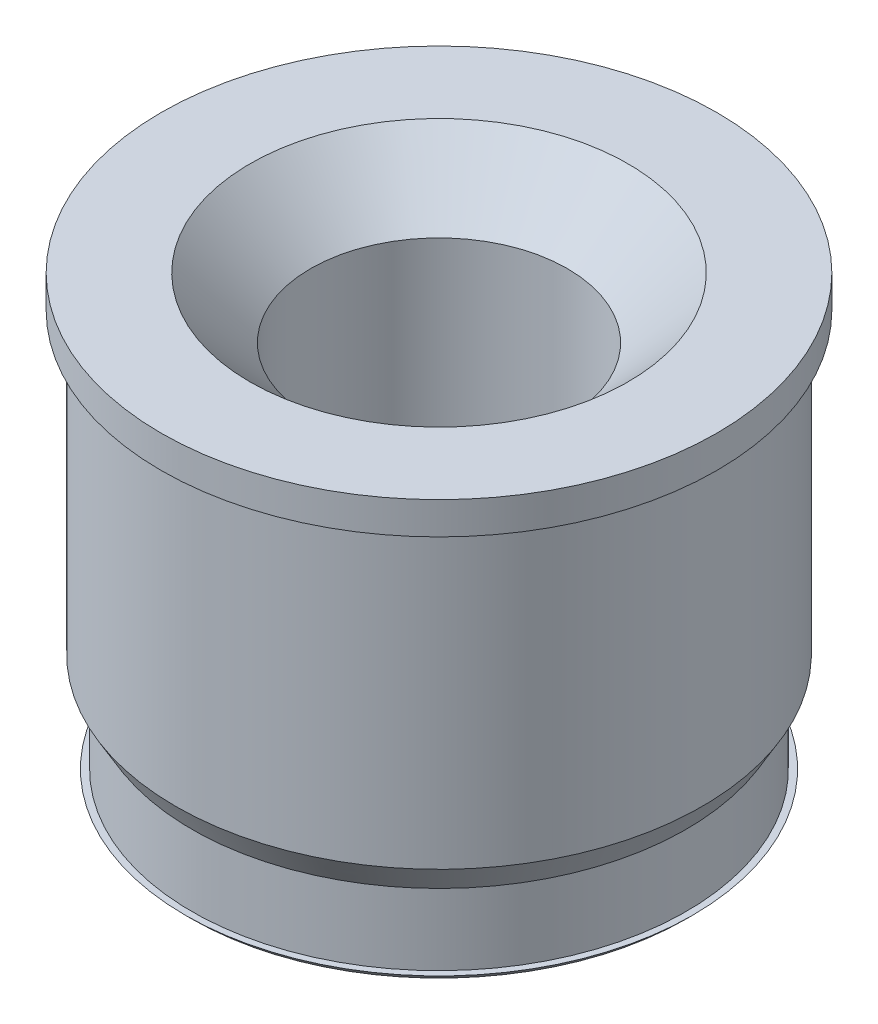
ISO-10303-21;
HEADER;
FILE_DESCRIPTION(('STEP AP214'),'2;1');
FILE_NAME('part.step','',(''),(''),'','','');
FILE_SCHEMA(('AUTOMOTIVE_DESIGN { 1 0 10303 214 1 1 1 1 }'));
ENDSEC;
DATA;
#1=APPLICATION_CONTEXT('core data for automotive mechanical design processes');
#2=APPLICATION_PROTOCOL_DEFINITION('international standard','automotive_design',2000,#1);
#3=PRODUCT_CONTEXT('',#1,'mechanical');
#4=PRODUCT('Part','Part','',(#3));
#5=PRODUCT_RELATED_PRODUCT_CATEGORY('part','',(#4));
#6=PRODUCT_DEFINITION_FORMATION('','',#4);
#7=PRODUCT_DEFINITION_CONTEXT('part definition',#1,'design');
#8=PRODUCT_DEFINITION('design','',#6,#7);
#9=PRODUCT_DEFINITION_SHAPE('','',#8);
#10=(LENGTH_UNIT() NAMED_UNIT(*) SI_UNIT(.MILLI.,.METRE.));
#11=(NAMED_UNIT(*) PLANE_ANGLE_UNIT() SI_UNIT($,.RADIAN.));
#12=(NAMED_UNIT(*) SI_UNIT($,.STERADIAN.) SOLID_ANGLE_UNIT());
#13=UNCERTAINTY_MEASURE_WITH_UNIT(LENGTH_MEASURE(1.E-05),#10,'distance_accuracy_value','');
#14=(GEOMETRIC_REPRESENTATION_CONTEXT(3) GLOBAL_UNCERTAINTY_ASSIGNED_CONTEXT((#13)) GLOBAL_UNIT_ASSIGNED_CONTEXT((#10,
#11,#12)) REPRESENTATION_CONTEXT('',''));
#15=CARTESIAN_POINT('',(0.,0.,0.));
#16=DIRECTION('',(0.,0.,1.));
#17=DIRECTION('',(1.,0.,0.));
#18=AXIS2_PLACEMENT_3D('',#15,#16,#17);
#19=CARTESIAN_POINT('',(0.,-3.429,0.));
#20=DIRECTION('',(0.,1.,0.));
#21=DIRECTION('',(0.,0.,1.));
#22=AXIS2_PLACEMENT_3D('',#19,#20,#21);
#23=CYLINDRICAL_SURFACE('',#22,1.9431);
#24=CARTESIAN_POINT('',(0.,-2.8184881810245,0.));
#25=DIRECTION('',(0.,-1.,0.));
#26=DIRECTION('',(0.,0.,-1.));
#27=AXIS2_PLACEMENT_3D('',#24,#25,#26);
#28=CIRCLE('',#27,1.9431);
#29=CARTESIAN_POINT('',(0.,-2.8184881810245,-1.9431));
#30=VERTEX_POINT('',#29);
#31=EDGE_CURVE('E55',#30,#30,#28,.F.);
#32=ORIENTED_EDGE('',*,*,#31,.F.);
#33=EDGE_LOOP('',(#32));
#34=FACE_BOUND('',#33,.T.);
#35=CARTESIAN_POINT('',(0.,-3.3782,0.));
#36=DIRECTION('',(0.,-1.,0.));
#37=DIRECTION('',(0.,0.,-1.));
#38=AXIS2_PLACEMENT_3D('',#35,#36,#37);
#39=CIRCLE('',#38,1.9431);
#40=CARTESIAN_POINT('',(0.,-3.3782,-1.9431));
#41=VERTEX_POINT('',#40);
#42=EDGE_CURVE('E56',#41,#41,#39,.F.);
#43=ORIENTED_EDGE('',*,*,#42,.T.);
#44=EDGE_LOOP('',(#43));
#45=FACE_BOUND('',#44,.T.);
#46=ADVANCED_FACE('F35',(#34,#45),#23,.T.);
#47=CARTESIAN_POINT('',(0.,-2.59851772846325,0.));
#48=DIRECTION('',(0.,1.,0.));
#49=DIRECTION('',(0.,0.,1.));
#50=AXIS2_PLACEMENT_3D('',#47,#48,#49);
#51=CYLINDRICAL_SURFACE('',#50,2.0701);
#52=CARTESIAN_POINT('',(0.,-2.59851772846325,0.));
#53=DIRECTION('',(0.,-1.,0.));
#54=DIRECTION('',(0.,0.,-1.));
#55=AXIS2_PLACEMENT_3D('',#52,#53,#54);
#56=CIRCLE('',#55,2.0701);
#57=CARTESIAN_POINT('',(0.,-2.59851772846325,-2.0701));
#58=VERTEX_POINT('',#57);
#59=EDGE_CURVE('E59',#58,#58,#56,.T.);
#60=ORIENTED_EDGE('',*,*,#59,.F.);
#61=EDGE_LOOP('',(#60));
#62=FACE_BOUND('',#61,.T.);
#63=CARTESIAN_POINT('',(0.,-0.254,0.));
#64=DIRECTION('',(0.,1.,0.));
#65=DIRECTION('',(0.,0.,1.));
#66=AXIS2_PLACEMENT_3D('',#63,#64,#65);
#67=CIRCLE('',#66,2.0701);
#68=CARTESIAN_POINT('',(0.,-0.254,2.0701));
#69=VERTEX_POINT('',#68);
#70=EDGE_CURVE('E64',#69,#69,#67,.F.);
#71=ORIENTED_EDGE('',*,*,#70,.T.);
#72=EDGE_LOOP('',(#71));
#73=FACE_BOUND('',#72,.T.);
#74=ADVANCED_FACE('F99',(#62,#73),#51,.T.);
#75=CARTESIAN_POINT('',(0.,-0.254,0.));
#76=DIRECTION('',(0.,1.,0.));
#77=DIRECTION('',(0.,0.,1.));
#78=AXIS2_PLACEMENT_3D('',#75,#76,#77);
#79=CYLINDRICAL_SURFACE('',#78,2.1844);
#80=CARTESIAN_POINT('',(0.,-0.254,0.));
#81=DIRECTION('',(0.,1.,0.));
#82=DIRECTION('',(0.,0.,1.));
#83=AXIS2_PLACEMENT_3D('',#80,#81,#82);
#84=CIRCLE('',#83,2.1844);
#85=CARTESIAN_POINT('',(0.,-0.254,2.1844));
#86=VERTEX_POINT('',#85);
#87=EDGE_CURVE('E67',#86,#86,#84,.T.);
#88=ORIENTED_EDGE('',*,*,#87,.T.);
#89=EDGE_LOOP('',(#88));
#90=FACE_BOUND('',#89,.T.);
#91=CARTESIAN_POINT('',(0.,0.,0.));
#92=DIRECTION('',(0.,1.,0.));
#93=DIRECTION('',(0.,0.,1.));
#94=AXIS2_PLACEMENT_3D('',#91,#92,#93);
#95=CIRCLE('',#94,2.1844);
#96=CARTESIAN_POINT('',(0.,0.,2.1844));
#97=VERTEX_POINT('',#96);
#98=EDGE_CURVE('E70',#97,#97,#95,.T.);
#99=ORIENTED_EDGE('',*,*,#98,.F.);
#100=EDGE_LOOP('',(#99));
#101=FACE_BOUND('',#100,.T.);
#102=ADVANCED_FACE('F105',(#90,#101),#79,.T.);
#103=CARTESIAN_POINT('',(0.,-0.254,0.));
#104=DIRECTION('',(0.,1.,0.));
#105=DIRECTION('',(0.,0.,1.));
#106=AXIS2_PLACEMENT_3D('',#103,#104,#105);
#107=PLANE('',#106);
#108=ORIENTED_EDGE('',*,*,#70,.F.);
#109=EDGE_LOOP('',(#108));
#110=FACE_BOUND('',#109,.T.);
#111=ORIENTED_EDGE('',*,*,#87,.F.);
#112=EDGE_LOOP('',(#111));
#113=FACE_BOUND('',#112,.T.);
#114=ADVANCED_FACE('F141',(#110,#113),#107,.F.);
#115=CARTESIAN_POINT('',(0.,0.,0.));
#116=DIRECTION('',(0.,1.,0.));
#117=DIRECTION('',(0.,0.,1.));
#118=AXIS2_PLACEMENT_3D('',#115,#116,#117);
#119=PLANE('',#118);
#120=CARTESIAN_POINT('',(0.,0.,0.));
#121=DIRECTION('',(0.,1.,0.));
#122=DIRECTION('',(0.,0.,1.));
#123=AXIS2_PLACEMENT_3D('',#120,#121,#122);
#124=CIRCLE('',#123,1.48620540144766);
#125=CARTESIAN_POINT('',(0.,0.,1.48620540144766));
#126=VERTEX_POINT('',#125);
#127=EDGE_CURVE('E42',#126,#126,#124,.F.);
#128=ORIENTED_EDGE('',*,*,#127,.T.);
#129=EDGE_LOOP('',(#128));
#130=FACE_BOUND('',#129,.T.);
#131=ORIENTED_EDGE('',*,*,#98,.T.);
#132=EDGE_LOOP('',(#131));
#133=FACE_BOUND('',#132,.T.);
#134=ADVANCED_FACE('F111',(#130,#133),#119,.T.);
#135=CARTESIAN_POINT('',(0.,-2.59851772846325,0.));
#136=DIRECTION('',(0.,1.,0.));
#137=DIRECTION('',(0.,0.,-1.));
#138=AXIS2_PLACEMENT_3D('',#135,#136,#137);
#139=CONICAL_SURFACE('',#138,2.0701,0.5235987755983);
#140=ORIENTED_EDGE('',*,*,#31,.T.);
#141=EDGE_LOOP('',(#140));
#142=FACE_BOUND('',#141,.T.);
#143=ORIENTED_EDGE('',*,*,#59,.T.);
#144=EDGE_LOOP('',(#143));
#145=FACE_BOUND('',#144,.T.);
#146=ADVANCED_FACE('F93',(#142,#145),#139,.T.);
#147=CARTESIAN_POINT('',(0.,-3.3782,0.));
#148=DIRECTION('',(0.,1.,0.));
#149=DIRECTION('',(0.,0.,-1.));
#150=AXIS2_PLACEMENT_3D('',#147,#148,#149);
#151=CONICAL_SURFACE('',#150,1.9939,0.78539816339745);
#152=CARTESIAN_POINT('',(0.,-3.429,0.));
#153=DIRECTION('',(0.,1.,0.));
#154=DIRECTION('',(0.,0.,1.));
#155=AXIS2_PLACEMENT_3D('',#152,#153,#154);
#156=CIRCLE('',#155,1.9431);
#157=CARTESIAN_POINT('',(0.,-3.429,1.9431));
#158=VERTEX_POINT('',#157);
#159=EDGE_CURVE('E63',#158,#158,#156,.T.);
#160=ORIENTED_EDGE('',*,*,#159,.T.);
#161=EDGE_LOOP('',(#160));
#162=FACE_BOUND('',#161,.T.);
#163=CARTESIAN_POINT('',(0.,-3.3782,0.));
#164=DIRECTION('',(0.,-1.,0.));
#165=DIRECTION('',(0.,0.,-1.));
#166=AXIS2_PLACEMENT_3D('',#163,#164,#165);
#167=CIRCLE('',#166,1.9939);
#168=CARTESIAN_POINT('',(0.,-3.3782,-1.9939));
#169=VERTEX_POINT('',#168);
#170=EDGE_CURVE('E60',#169,#169,#167,.T.);
#171=ORIENTED_EDGE('',*,*,#170,.T.);
#172=EDGE_LOOP('',(#171));
#173=FACE_BOUND('',#172,.T.);
#174=ADVANCED_FACE('F80',(#162,#173),#151,.T.);
#175=CARTESIAN_POINT('',(0.,-3.3782,0.));
#176=DIRECTION('',(0.,-1.,0.));
#177=DIRECTION('',(0.,0.,-1.));
#178=AXIS2_PLACEMENT_3D('',#175,#176,#177);
#179=PLANE('',#178);
#180=ORIENTED_EDGE('',*,*,#42,.F.);
#181=EDGE_LOOP('',(#180));
#182=FACE_BOUND('',#181,.T.);
#183=ORIENTED_EDGE('',*,*,#170,.F.);
#184=EDGE_LOOP('',(#183));
#185=FACE_BOUND('',#184,.T.);
#186=ADVANCED_FACE('F82',(#182,#185),#179,.F.);
#187=CARTESIAN_POINT('',(0.,-3.429,0.));
#188=DIRECTION('',(0.,1.,0.));
#189=DIRECTION('',(0.,0.,1.));
#190=AXIS2_PLACEMENT_3D('',#187,#188,#189);
#191=PLANE('',#190);
#192=CARTESIAN_POINT('',(0.,-3.429,0.));
#193=DIRECTION('',(0.,1.,0.));
#194=DIRECTION('',(0.,0.,1.));
#195=AXIS2_PLACEMENT_3D('',#192,#193,#194);
#196=CIRCLE('',#195,1.48620540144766);
#197=CARTESIAN_POINT('',(0.,-3.429,1.48620540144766));
#198=VERTEX_POINT('',#197);
#199=EDGE_CURVE('E10',#198,#198,#196,.T.);
#200=ORIENTED_EDGE('',*,*,#199,.T.);
#201=EDGE_LOOP('',(#200));
#202=FACE_BOUND('',#201,.T.);
#203=ORIENTED_EDGE('',*,*,#159,.F.);
#204=EDGE_LOOP('',(#203));
#205=FACE_BOUND('',#204,.T.);
#206=ADVANCED_FACE('F84',(#202,#205),#191,.F.);
#207=CARTESIAN_POINT('',(0.,-3.429,0.));
#208=DIRECTION('',(0.,1.,0.));
#209=DIRECTION('',(0.,0.,1.));
#210=AXIS2_PLACEMENT_3D('',#207,#208,#209);
#211=CYLINDRICAL_SURFACE('',#210,1.00995540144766);
#212=CARTESIAN_POINT('',(0.,-0.476249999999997,0.));
#213=DIRECTION('',(0.,1.,0.));
#214=DIRECTION('',(0.,0.,1.));
#215=AXIS2_PLACEMENT_3D('',#212,#213,#214);
#216=CIRCLE('',#215,1.00995540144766);
#217=CARTESIAN_POINT('',(0.,-0.476249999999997,1.00995540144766));
#218=VERTEX_POINT('',#217);
#219=EDGE_CURVE('E46',#218,#218,#216,.T.);
#220=ORIENTED_EDGE('',*,*,#219,.T.);
#221=EDGE_LOOP('',(#220));
#222=FACE_BOUND('',#221,.T.);
#223=CARTESIAN_POINT('',(0.,-2.95275,0.));
#224=DIRECTION('',(0.,1.,0.));
#225=DIRECTION('',(0.,0.,1.));
#226=AXIS2_PLACEMENT_3D('',#223,#224,#225);
#227=CIRCLE('',#226,1.00995540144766);
#228=CARTESIAN_POINT('',(0.,-2.95275,1.00995540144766));
#229=VERTEX_POINT('',#228);
#230=EDGE_CURVE('E50',#229,#229,#227,.F.);
#231=ORIENTED_EDGE('',*,*,#230,.T.);
#232=EDGE_LOOP('',(#231));
#233=FACE_BOUND('',#232,.T.);
#234=ADVANCED_FACE('F91',(#222,#233),#211,.F.);
#235=CARTESIAN_POINT('',(0.,-0.476249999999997,0.));
#236=DIRECTION('',(0.,1.,0.));
#237=DIRECTION('',(0.,0.,1.));
#238=AXIS2_PLACEMENT_3D('',#235,#236,#237);
#239=CONICAL_SURFACE('',#238,1.00995540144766,0.78539816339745);
#240=ORIENTED_EDGE('',*,*,#127,.F.);
#241=EDGE_LOOP('',(#240));
#242=FACE_BOUND('',#241,.T.);
#243=ORIENTED_EDGE('',*,*,#219,.F.);
#244=EDGE_LOOP('',(#243));
#245=FACE_BOUND('',#244,.T.);
#246=ADVANCED_FACE('F112',(#242,#245),#239,.F.);
#247=CARTESIAN_POINT('',(0.,-3.429,0.));
#248=DIRECTION('',(0.,-1.,0.));
#249=DIRECTION('',(0.,0.,-1.));
#250=AXIS2_PLACEMENT_3D('',#247,#248,#249);
#251=CONICAL_SURFACE('',#250,1.48620540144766,0.785398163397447);
#252=ORIENTED_EDGE('',*,*,#230,.F.);
#253=EDGE_LOOP('',(#252));
#254=FACE_BOUND('',#253,.T.);
#255=ORIENTED_EDGE('',*,*,#199,.F.);
#256=EDGE_LOOP('',(#255));
#257=FACE_BOUND('',#256,.T.);
#258=ADVANCED_FACE('F37',(#254,#257),#251,.F.);
#259=CLOSED_SHELL('',(#46,#74,#102,#114,#134,#146,#174,#186,#206,#234,#246,#258));
#260=MANIFOLD_SOLID_BREP('B2',#259);
#261=ADVANCED_BREP_SHAPE_REPRESENTATION('',(#18,#260),#14);
#262=SHAPE_DEFINITION_REPRESENTATION(#9,#261);
ENDSEC;
END-ISO-10303-21;
